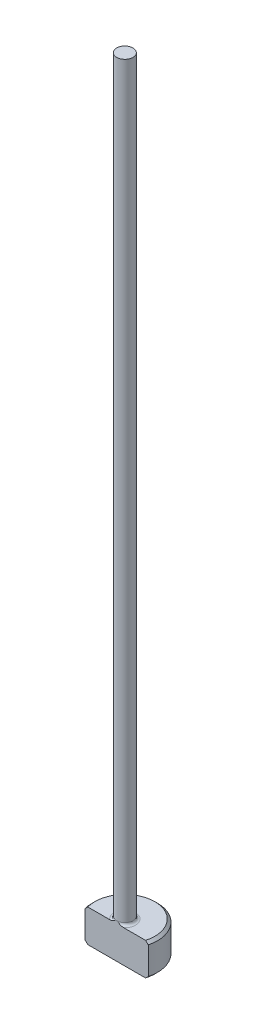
from build123d import *

# Parameters (mm, degrees)
CHAMFER1_SIZE = 0.254
FILLET1_R     = 0.254
KEY_DEPTH     = 77.332177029


with BuildPart() as part:
    # Sketch1 → Revolve1 (revolve)
    with BuildSketch(Plane.XY, mode=Mode.PRIVATE) as revolve1_sk:
        Polygon((0, 0), (-3.175, 0), (-3.175, 3.175), (-0.79375, 3.175), (-0.79375, 76.2), (0, 76.2), align=None)
    revolve(revolve1_sk.sketch.rotate(Axis((0, 259.958771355, 0), (0, -1, 0)), 270), axis=Axis((0, 259.958771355, 0), (0, -1, 0)))

    # Chamfer1
    chamfer1_edges = [part.edges().sort_by_distance(p)[0] for p in [
        (0, 3.175, -3.175),
        (0, 0, -3.175),
    ]]
    chamfer(chamfer1_edges, length=CHAMFER1_SIZE)

    # Fillet1
    fillet1_edges = [part.edges().sort_by_distance(p)[0] for p in [
        (0, 3.175, -0.79375),
    ]]
    fillet(fillet1_edges, radius=FILLET1_R)

    # Sketch2 → Key (cut, through all)
    with BuildSketch(Plane(origin=(0, 0, 0), x_dir=(1, 0, 0), z_dir=(0, 1, 0))):
        with BuildLine():
            Line((-3.074180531, -0.79375), (3.074180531, -0.79375))
            ThreePointArc((3.074180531, -0.79375), (0, -3.175), (-3.074180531, -0.79375))
        make_face()
    extrude(amount=KEY_DEPTH, mode=Mode.SUBTRACT)


solid = part.part
